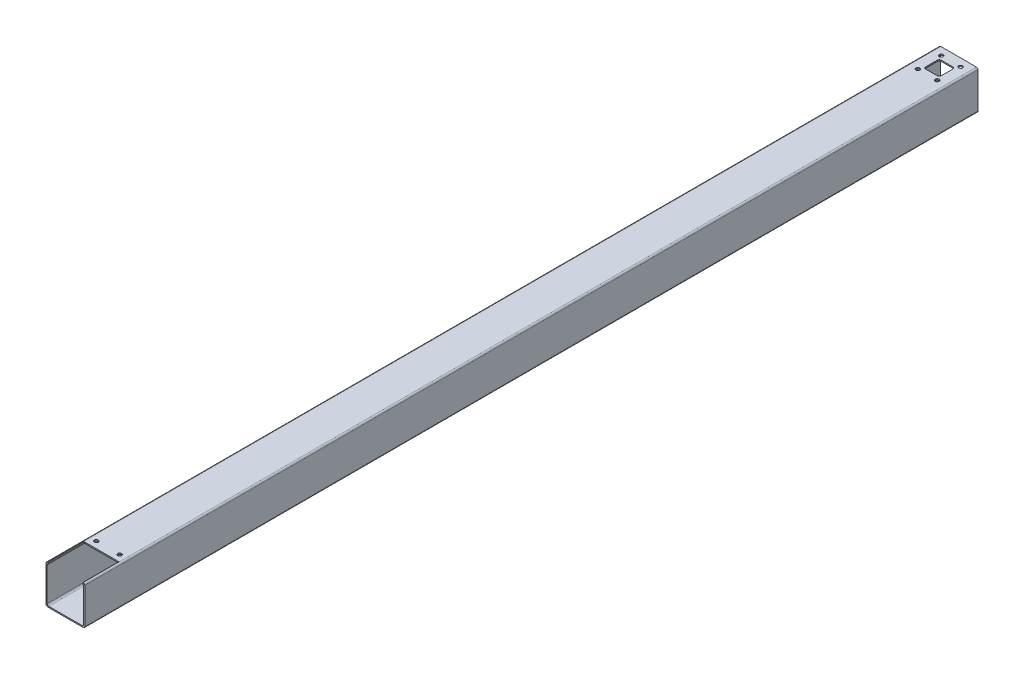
ISO-10303-21;
HEADER;
FILE_DESCRIPTION(('STEP AP214'),'2;1');
FILE_NAME('part.step','',(''),(''),'','','');
FILE_SCHEMA(('AUTOMOTIVE_DESIGN { 1 0 10303 214 1 1 1 1 }'));
ENDSEC;
DATA;
#1=APPLICATION_CONTEXT('core data for automotive mechanical design processes');
#2=APPLICATION_PROTOCOL_DEFINITION('international standard','automotive_design',2000,#1);
#3=PRODUCT_CONTEXT('',#1,'mechanical');
#4=PRODUCT('Part','Part','',(#3));
#5=PRODUCT_RELATED_PRODUCT_CATEGORY('part','',(#4));
#6=PRODUCT_DEFINITION_FORMATION('','',#4);
#7=PRODUCT_DEFINITION_CONTEXT('part definition',#1,'design');
#8=PRODUCT_DEFINITION('design','',#6,#7);
#9=PRODUCT_DEFINITION_SHAPE('','',#8);
#10=(LENGTH_UNIT() NAMED_UNIT(*) SI_UNIT(.MILLI.,.METRE.));
#11=(NAMED_UNIT(*) PLANE_ANGLE_UNIT() SI_UNIT($,.RADIAN.));
#12=(NAMED_UNIT(*) SI_UNIT($,.STERADIAN.) SOLID_ANGLE_UNIT());
#13=UNCERTAINTY_MEASURE_WITH_UNIT(LENGTH_MEASURE(1.E-05),#10,'distance_accuracy_value','');
#14=(GEOMETRIC_REPRESENTATION_CONTEXT(3) GLOBAL_UNCERTAINTY_ASSIGNED_CONTEXT((#13)) GLOBAL_UNIT_ASSIGNED_CONTEXT((#10,
#11,#12)) REPRESENTATION_CONTEXT('',''));
#15=CARTESIAN_POINT('',(0.,0.,0.));
#16=DIRECTION('',(0.,0.,1.));
#17=DIRECTION('',(1.,0.,0.));
#18=AXIS2_PLACEMENT_3D('',#15,#16,#17);
#19=CARTESIAN_POINT('',(0.,0.,2304.));
#20=DIRECTION('',(0.,0.,1.));
#21=DIRECTION('',(1.,0.,0.));
#22=AXIS2_PLACEMENT_3D('',#19,#20,#21);
#23=PLANE('',#22);
#24=DIRECTION('',(0.,1.,0.));
#25=VECTOR('',#24,1.);
#26=CARTESIAN_POINT('',(5.00000000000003,90.,2304.));
#27=LINE('',#26,#25);
#28=CARTESIAN_POINT('',(5.00000000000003,96.4641016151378,2304.));
#29=VERTEX_POINT('',#28);
#30=CARTESIAN_POINT('',(5.00000000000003,100.,2304.));
#31=VERTEX_POINT('',#30);
#32=EDGE_CURVE('E312',#29,#31,#27,.T.);
#33=ORIENTED_EDGE('',*,*,#32,.T.);
#34=DIRECTION('',(-1.,0.,0.));
#35=VECTOR('',#34,1.);
#36=CARTESIAN_POINT('',(0.,100.,2304.));
#37=LINE('',#36,#35);
#38=CARTESIAN_POINT('',(4.,100.,2304.));
#39=VERTEX_POINT('',#38);
#40=EDGE_CURVE('E325',#31,#39,#37,.T.);
#41=ORIENTED_EDGE('',*,*,#40,.T.);
#42=CARTESIAN_POINT('',(4.,96.,2304.));
#43=DIRECTION('',(0.,0.,1.));
#44=DIRECTION('',(1.,0.,0.));
#45=AXIS2_PLACEMENT_3D('',#42,#43,#44);
#46=CIRCLE('',#45,4.);
#47=CARTESIAN_POINT('',(0.,96.,2304.));
#48=VERTEX_POINT('',#47);
#49=EDGE_CURVE('E399',#39,#48,#46,.T.);
#50=ORIENTED_EDGE('',*,*,#49,.T.);
#51=DIRECTION('',(0.,-1.,0.));
#52=VECTOR('',#51,1.);
#53=CARTESIAN_POINT('',(0.,0.,2304.));
#54=LINE('',#53,#52);
#55=CARTESIAN_POINT('',(0.,4.,2304.));
#56=VERTEX_POINT('',#55);
#57=EDGE_CURVE('E370',#48,#56,#54,.T.);
#58=ORIENTED_EDGE('',*,*,#57,.T.);
#59=CARTESIAN_POINT('',(4.,4.,2304.));
#60=DIRECTION('',(0.,0.,1.));
#61=DIRECTION('',(1.,0.,0.));
#62=AXIS2_PLACEMENT_3D('',#59,#60,#61);
#63=CIRCLE('',#62,4.);
#64=CARTESIAN_POINT('',(4.,0.,2304.));
#65=VERTEX_POINT('',#64);
#66=EDGE_CURVE('E401',#56,#65,#63,.T.);
#67=ORIENTED_EDGE('',*,*,#66,.T.);
#68=DIRECTION('',(1.,0.,0.));
#69=VECTOR('',#68,1.);
#70=CARTESIAN_POINT('',(0.,0.,2304.));
#71=LINE('',#70,#69);
#72=CARTESIAN_POINT('',(96.,0.,2304.));
#73=VERTEX_POINT('',#72);
#74=EDGE_CURVE('E350',#65,#73,#71,.T.);
#75=ORIENTED_EDGE('',*,*,#74,.T.);
#76=CARTESIAN_POINT('',(96.,4.,2304.));
#77=DIRECTION('',(0.,0.,1.));
#78=DIRECTION('',(1.,0.,0.));
#79=AXIS2_PLACEMENT_3D('',#76,#77,#78);
#80=CIRCLE('',#79,4.);
#81=CARTESIAN_POINT('',(100.,4.,2304.));
#82=VERTEX_POINT('',#81);
#83=EDGE_CURVE('E404',#73,#82,#80,.T.);
#84=ORIENTED_EDGE('',*,*,#83,.T.);
#85=DIRECTION('',(0.,1.,0.));
#86=VECTOR('',#85,1.);
#87=CARTESIAN_POINT('',(100.,0.,2304.));
#88=LINE('',#87,#86);
#89=CARTESIAN_POINT('',(100.,96.,2304.));
#90=VERTEX_POINT('',#89);
#91=EDGE_CURVE('E341',#82,#90,#88,.T.);
#92=ORIENTED_EDGE('',*,*,#91,.T.);
#93=CARTESIAN_POINT('',(96.,96.,2304.));
#94=DIRECTION('',(0.,0.,1.));
#95=DIRECTION('',(1.,0.,0.));
#96=AXIS2_PLACEMENT_3D('',#93,#94,#95);
#97=CIRCLE('',#96,4.);
#98=CARTESIAN_POINT('',(96.,100.,2304.));
#99=VERTEX_POINT('',#98);
#100=EDGE_CURVE('E396',#90,#99,#97,.T.);
#101=ORIENTED_EDGE('',*,*,#100,.T.);
#102=CARTESIAN_POINT('',(95.,100.,2304.));
#103=VERTEX_POINT('',#102);
#104=EDGE_CURVE('E340',#99,#103,#37,.T.);
#105=ORIENTED_EDGE('',*,*,#104,.T.);
#106=DIRECTION('',(0.,1.,0.));
#107=VECTOR('',#106,1.);
#108=CARTESIAN_POINT('',(95.,90.,2304.));
#109=LINE('',#108,#107);
#110=CARTESIAN_POINT('',(95.,96.4641016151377,2304.));
#111=VERTEX_POINT('',#110);
#112=EDGE_CURVE('E331',#111,#103,#109,.T.);
#113=ORIENTED_EDGE('',*,*,#112,.F.);
#114=CARTESIAN_POINT('',(93.,93.,2304.));
#115=DIRECTION('',(0.,0.,1.));
#116=DIRECTION('',(1.,0.,0.));
#117=AXIS2_PLACEMENT_3D('',#114,#115,#116);
#118=CIRCLE('',#117,4.);
#119=CARTESIAN_POINT('',(97.,93.,2304.));
#120=VERTEX_POINT('',#119);
#121=EDGE_CURVE('E463',#111,#120,#118,.F.);
#122=ORIENTED_EDGE('',*,*,#121,.T.);
#123=DIRECTION('',(0.,1.,0.));
#124=VECTOR('',#123,1.);
#125=CARTESIAN_POINT('',(97.,100.,2304.));
#126=LINE('',#125,#124);
#127=CARTESIAN_POINT('',(97.,7.00000000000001,2304.));
#128=VERTEX_POINT('',#127);
#129=EDGE_CURVE('E359',#128,#120,#126,.T.);
#130=ORIENTED_EDGE('',*,*,#129,.F.);
#131=CARTESIAN_POINT('',(93.,7.,2304.));
#132=DIRECTION('',(0.,0.,1.));
#133=DIRECTION('',(1.,0.,0.));
#134=AXIS2_PLACEMENT_3D('',#131,#132,#133);
#135=CIRCLE('',#134,4.);
#136=CARTESIAN_POINT('',(93.,3.,2304.));
#137=VERTEX_POINT('',#136);
#138=EDGE_CURVE('E457',#128,#137,#135,.F.);
#139=ORIENTED_EDGE('',*,*,#138,.T.);
#140=DIRECTION('',(1.,0.,0.));
#141=VECTOR('',#140,1.);
#142=CARTESIAN_POINT('',(0.,3.,2304.));
#143=LINE('',#142,#141);
#144=CARTESIAN_POINT('',(7.,3.,2304.));
#145=VERTEX_POINT('',#144);
#146=EDGE_CURVE('E623',#145,#137,#143,.T.);
#147=ORIENTED_EDGE('',*,*,#146,.F.);
#148=CARTESIAN_POINT('',(7.,7.00000000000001,2304.));
#149=DIRECTION('',(0.,0.,1.));
#150=DIRECTION('',(1.,0.,0.));
#151=AXIS2_PLACEMENT_3D('',#148,#149,#150);
#152=CIRCLE('',#151,4.);
#153=CARTESIAN_POINT('',(3.,7.00000000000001,2304.));
#154=VERTEX_POINT('',#153);
#155=EDGE_CURVE('E451',#145,#154,#152,.F.);
#156=ORIENTED_EDGE('',*,*,#155,.T.);
#157=DIRECTION('',(0.,-1.,0.));
#158=VECTOR('',#157,1.);
#159=CARTESIAN_POINT('',(3.,100.,2304.));
#160=LINE('',#159,#158);
#161=CARTESIAN_POINT('',(3.,93.,2304.));
#162=VERTEX_POINT('',#161);
#163=EDGE_CURVE('E592',#162,#154,#160,.T.);
#164=ORIENTED_EDGE('',*,*,#163,.F.);
#165=CARTESIAN_POINT('',(7.,93.,2304.));
#166=DIRECTION('',(0.,0.,1.));
#167=DIRECTION('',(1.,0.,0.));
#168=AXIS2_PLACEMENT_3D('',#165,#166,#167);
#169=CIRCLE('',#168,4.);
#170=EDGE_CURVE('E329',#162,#29,#169,.F.);
#171=ORIENTED_EDGE('',*,*,#170,.T.);
#172=EDGE_LOOP('',(#33,#41,#50,#58,#67,#75,#84,#92,#101,#105,#113,#122,#130,#139,#147,#156,#164,#171));
#173=FACE_BOUND('',#172,.T.);
#174=ADVANCED_FACE('F67',(#173),#23,.T.);
#175=CARTESIAN_POINT('',(0.,0.,0.));
#176=DIRECTION('',(0.,0.,1.));
#177=DIRECTION('',(1.,0.,0.));
#178=AXIS2_PLACEMENT_3D('',#175,#176,#177);
#179=PLANE('',#178);
#180=DIRECTION('',(0.,1.,0.));
#181=VECTOR('',#180,1.);
#182=CARTESIAN_POINT('',(100.,0.,0.));
#183=LINE('',#182,#181);
#184=CARTESIAN_POINT('',(100.,4.,0.));
#185=VERTEX_POINT('',#184);
#186=CARTESIAN_POINT('',(100.,96.,0.));
#187=VERTEX_POINT('',#186);
#188=EDGE_CURVE('E363',#185,#187,#183,.T.);
#189=ORIENTED_EDGE('',*,*,#188,.F.);
#190=CARTESIAN_POINT('',(96.,4.,0.));
#191=DIRECTION('',(0.,0.,1.));
#192=DIRECTION('',(1.,0.,0.));
#193=AXIS2_PLACEMENT_3D('',#190,#191,#192);
#194=CIRCLE('',#193,4.);
#195=CARTESIAN_POINT('',(96.,0.,0.));
#196=VERTEX_POINT('',#195);
#197=EDGE_CURVE('E386',#185,#196,#194,.F.);
#198=ORIENTED_EDGE('',*,*,#197,.T.);
#199=DIRECTION('',(1.,0.,0.));
#200=VECTOR('',#199,1.);
#201=CARTESIAN_POINT('',(0.,0.,0.));
#202=LINE('',#201,#200);
#203=CARTESIAN_POINT('',(4.,0.,0.));
#204=VERTEX_POINT('',#203);
#205=EDGE_CURVE('E358',#204,#196,#202,.T.);
#206=ORIENTED_EDGE('',*,*,#205,.F.);
#207=CARTESIAN_POINT('',(4.,4.,0.));
#208=DIRECTION('',(0.,0.,1.));
#209=DIRECTION('',(1.,0.,0.));
#210=AXIS2_PLACEMENT_3D('',#207,#208,#209);
#211=CIRCLE('',#210,4.);
#212=CARTESIAN_POINT('',(0.,4.,0.));
#213=VERTEX_POINT('',#212);
#214=EDGE_CURVE('E383',#204,#213,#211,.F.);
#215=ORIENTED_EDGE('',*,*,#214,.T.);
#216=DIRECTION('',(0.,-1.,0.));
#217=VECTOR('',#216,1.);
#218=CARTESIAN_POINT('',(0.,0.,0.));
#219=LINE('',#218,#217);
#220=CARTESIAN_POINT('',(0.,96.,0.));
#221=VERTEX_POINT('',#220);
#222=EDGE_CURVE('E354',#221,#213,#219,.T.);
#223=ORIENTED_EDGE('',*,*,#222,.F.);
#224=CARTESIAN_POINT('',(4.,96.,0.));
#225=DIRECTION('',(0.,0.,1.));
#226=DIRECTION('',(1.,0.,0.));
#227=AXIS2_PLACEMENT_3D('',#224,#225,#226);
#228=CIRCLE('',#227,4.);
#229=CARTESIAN_POINT('',(4.,100.,0.));
#230=VERTEX_POINT('',#229);
#231=EDGE_CURVE('E380',#221,#230,#228,.F.);
#232=ORIENTED_EDGE('',*,*,#231,.T.);
#233=DIRECTION('',(-1.,0.,0.));
#234=VECTOR('',#233,1.);
#235=CARTESIAN_POINT('',(0.,100.,0.));
#236=LINE('',#235,#234);
#237=CARTESIAN_POINT('',(96.,100.,0.));
#238=VERTEX_POINT('',#237);
#239=EDGE_CURVE('E367',#238,#230,#236,.T.);
#240=ORIENTED_EDGE('',*,*,#239,.F.);
#241=CARTESIAN_POINT('',(96.,96.,0.));
#242=DIRECTION('',(0.,0.,1.));
#243=DIRECTION('',(1.,0.,0.));
#244=AXIS2_PLACEMENT_3D('',#241,#242,#243);
#245=CIRCLE('',#244,4.);
#246=EDGE_CURVE('E377',#238,#187,#245,.F.);
#247=ORIENTED_EDGE('',*,*,#246,.T.);
#248=EDGE_LOOP('',(#189,#198,#206,#215,#223,#232,#240,#247));
#249=FACE_BOUND('',#248,.T.);
#250=DIRECTION('',(-1.,0.,0.));
#251=VECTOR('',#250,1.);
#252=CARTESIAN_POINT('',(0.,97.,0.));
#253=LINE('',#252,#251);
#254=CARTESIAN_POINT('',(93.,97.,0.));
#255=VERTEX_POINT('',#254);
#256=CARTESIAN_POINT('',(7.,97.,0.));
#257=VERTEX_POINT('',#256);
#258=EDGE_CURVE('E587',#255,#257,#253,.T.);
#259=ORIENTED_EDGE('',*,*,#258,.T.);
#260=CARTESIAN_POINT('',(7.,93.,0.));
#261=DIRECTION('',(0.,0.,1.));
#262=DIRECTION('',(1.,0.,0.));
#263=AXIS2_PLACEMENT_3D('',#260,#261,#262);
#264=CIRCLE('',#263,4.);
#265=CARTESIAN_POINT('',(3.,93.,0.));
#266=VERTEX_POINT('',#265);
#267=EDGE_CURVE('E466',#257,#266,#264,.T.);
#268=ORIENTED_EDGE('',*,*,#267,.T.);
#269=DIRECTION('',(0.,-1.,0.));
#270=VECTOR('',#269,1.);
#271=CARTESIAN_POINT('',(3.,100.,0.));
#272=LINE('',#271,#270);
#273=CARTESIAN_POINT('',(3.,7.00000000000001,0.));
#274=VERTEX_POINT('',#273);
#275=EDGE_CURVE('E576',#266,#274,#272,.T.);
#276=ORIENTED_EDGE('',*,*,#275,.T.);
#277=CARTESIAN_POINT('',(7.,7.00000000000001,0.));
#278=DIRECTION('',(0.,0.,1.));
#279=DIRECTION('',(1.,0.,0.));
#280=AXIS2_PLACEMENT_3D('',#277,#278,#279);
#281=CIRCLE('',#280,4.);
#282=CARTESIAN_POINT('',(7.,3.,0.));
#283=VERTEX_POINT('',#282);
#284=EDGE_CURVE('E448',#274,#283,#281,.T.);
#285=ORIENTED_EDGE('',*,*,#284,.T.);
#286=DIRECTION('',(1.,0.,0.));
#287=VECTOR('',#286,1.);
#288=CARTESIAN_POINT('',(0.,3.,0.));
#289=LINE('',#288,#287);
#290=CARTESIAN_POINT('',(93.,3.,0.));
#291=VERTEX_POINT('',#290);
#292=EDGE_CURVE('E578',#283,#291,#289,.T.);
#293=ORIENTED_EDGE('',*,*,#292,.T.);
#294=CARTESIAN_POINT('',(93.,7.,0.));
#295=DIRECTION('',(0.,0.,1.));
#296=DIRECTION('',(1.,0.,0.));
#297=AXIS2_PLACEMENT_3D('',#294,#295,#296);
#298=CIRCLE('',#297,4.);
#299=CARTESIAN_POINT('',(97.,7.00000000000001,0.));
#300=VERTEX_POINT('',#299);
#301=EDGE_CURVE('E454',#291,#300,#298,.T.);
#302=ORIENTED_EDGE('',*,*,#301,.T.);
#303=DIRECTION('',(0.,1.,0.));
#304=VECTOR('',#303,1.);
#305=CARTESIAN_POINT('',(97.,100.,0.));
#306=LINE('',#305,#304);
#307=CARTESIAN_POINT('',(97.,93.,0.));
#308=VERTEX_POINT('',#307);
#309=EDGE_CURVE('E583',#300,#308,#306,.T.);
#310=ORIENTED_EDGE('',*,*,#309,.T.);
#311=CARTESIAN_POINT('',(93.,93.,0.));
#312=DIRECTION('',(0.,0.,1.));
#313=DIRECTION('',(1.,0.,0.));
#314=AXIS2_PLACEMENT_3D('',#311,#312,#313);
#315=CIRCLE('',#314,4.);
#316=EDGE_CURVE('E460',#308,#255,#315,.T.);
#317=ORIENTED_EDGE('',*,*,#316,.T.);
#318=EDGE_LOOP('',(#259,#268,#276,#285,#293,#302,#310,#317));
#319=FACE_BOUND('',#318,.T.);
#320=ADVANCED_FACE('F649',(#249,#319),#179,.F.);
#321=CARTESIAN_POINT('',(0.,0.,2304.));
#322=DIRECTION('',(1.,0.,0.));
#323=DIRECTION('',(0.,0.,-1.));
#324=AXIS2_PLACEMENT_3D('',#321,#322,#323);
#325=PLANE('',#324);
#326=ORIENTED_EDGE('',*,*,#222,.T.);
#327=DIRECTION('',(0.,0.,-1.));
#328=VECTOR('',#327,1.);
#329=CARTESIAN_POINT('',(0.,4.,2304.));
#330=LINE('',#329,#328);
#331=EDGE_CURVE('E411',#213,#56,#330,.F.);
#332=ORIENTED_EDGE('',*,*,#331,.T.);
#333=ORIENTED_EDGE('',*,*,#57,.F.);
#334=DIRECTION('',(0.,0.,-1.));
#335=VECTOR('',#334,1.);
#336=CARTESIAN_POINT('',(0.,96.,2304.));
#337=LINE('',#336,#335);
#338=EDGE_CURVE('E407',#48,#221,#337,.T.);
#339=ORIENTED_EDGE('',*,*,#338,.T.);
#340=EDGE_LOOP('',(#326,#332,#333,#339));
#341=FACE_BOUND('',#340,.T.);
#342=ADVANCED_FACE('F741',(#341),#325,.F.);
#343=CARTESIAN_POINT('',(0.,0.,2304.));
#344=DIRECTION('',(0.,1.,0.));
#345=DIRECTION('',(0.,0.,1.));
#346=AXIS2_PLACEMENT_3D('',#343,#344,#345);
#347=PLANE('',#346);
#348=ORIENTED_EDGE('',*,*,#205,.T.);
#349=DIRECTION('',(0.,0.,-1.));
#350=VECTOR('',#349,1.);
#351=CARTESIAN_POINT('',(96.,0.,2304.));
#352=LINE('',#351,#350);
#353=EDGE_CURVE('E393',#196,#73,#352,.F.);
#354=ORIENTED_EDGE('',*,*,#353,.T.);
#355=ORIENTED_EDGE('',*,*,#74,.F.);
#356=DIRECTION('',(0.,0.,-1.));
#357=VECTOR('',#356,1.);
#358=CARTESIAN_POINT('',(4.,0.,2304.));
#359=LINE('',#358,#357);
#360=EDGE_CURVE('E389',#65,#204,#359,.T.);
#361=ORIENTED_EDGE('',*,*,#360,.T.);
#362=EDGE_LOOP('',(#348,#354,#355,#361));
#363=FACE_BOUND('',#362,.T.);
#364=ADVANCED_FACE('F731',(#363),#347,.F.);
#365=CARTESIAN_POINT('',(100.,0.,2304.));
#366=DIRECTION('',(-1.,0.,0.));
#367=DIRECTION('',(0.,0.,1.));
#368=AXIS2_PLACEMENT_3D('',#365,#366,#367);
#369=PLANE('',#368);
#370=ORIENTED_EDGE('',*,*,#91,.F.);
#371=DIRECTION('',(0.,0.,-1.));
#372=VECTOR('',#371,1.);
#373=CARTESIAN_POINT('',(100.,4.,2304.));
#374=LINE('',#373,#372);
#375=EDGE_CURVE('E373',#82,#185,#374,.T.);
#376=ORIENTED_EDGE('',*,*,#375,.T.);
#377=ORIENTED_EDGE('',*,*,#188,.T.);
#378=DIRECTION('',(0.,0.,-1.));
#379=VECTOR('',#378,1.);
#380=CARTESIAN_POINT('',(100.,96.,2304.));
#381=LINE('',#380,#379);
#382=EDGE_CURVE('E347',#187,#90,#381,.F.);
#383=ORIENTED_EDGE('',*,*,#382,.T.);
#384=EDGE_LOOP('',(#370,#376,#377,#383));
#385=FACE_BOUND('',#384,.T.);
#386=ADVANCED_FACE('F646',(#385),#369,.F.);
#387=CARTESIAN_POINT('',(0.,100.,2304.));
#388=DIRECTION('',(0.,-1.,0.));
#389=DIRECTION('',(0.,0.,-1.));
#390=AXIS2_PLACEMENT_3D('',#387,#388,#389);
#391=PLANE('',#390);
#392=CARTESIAN_POINT('',(25.,100.,20.));
#393=DIRECTION('',(0.,1.,0.));
#394=DIRECTION('',(0.,0.,1.));
#395=AXIS2_PLACEMENT_3D('',#392,#393,#394);
#396=CIRCLE('',#395,5.);
#397=CARTESIAN_POINT('',(25.,100.,25.));
#398=VERTEX_POINT('',#397);
#399=EDGE_CURVE('E528',#398,#398,#396,.T.);
#400=ORIENTED_EDGE('',*,*,#399,.F.);
#401=EDGE_LOOP('',(#400));
#402=FACE_BOUND('',#401,.T.);
#403=CARTESIAN_POINT('',(75.,100.,20.));
#404=DIRECTION('',(0.,1.,0.));
#405=DIRECTION('',(0.,0.,1.));
#406=AXIS2_PLACEMENT_3D('',#403,#404,#405);
#407=CIRCLE('',#406,5.);
#408=CARTESIAN_POINT('',(75.,100.,25.));
#409=VERTEX_POINT('',#408);
#410=EDGE_CURVE('E523',#409,#409,#407,.T.);
#411=ORIENTED_EDGE('',*,*,#410,.F.);
#412=EDGE_LOOP('',(#411));
#413=FACE_BOUND('',#412,.T.);
#414=CARTESIAN_POINT('',(75.,100.,80.));
#415=DIRECTION('',(0.,1.,0.));
#416=DIRECTION('',(0.,0.,1.));
#417=AXIS2_PLACEMENT_3D('',#414,#415,#416);
#418=CIRCLE('',#417,5.00000000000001);
#419=CARTESIAN_POINT('',(75.,100.,85.));
#420=VERTEX_POINT('',#419);
#421=EDGE_CURVE('E518',#420,#420,#418,.T.);
#422=ORIENTED_EDGE('',*,*,#421,.F.);
#423=EDGE_LOOP('',(#422));
#424=FACE_BOUND('',#423,.T.);
#425=CARTESIAN_POINT('',(25.,100.,80.));
#426=DIRECTION('',(0.,1.,0.));
#427=DIRECTION('',(0.,0.,1.));
#428=AXIS2_PLACEMENT_3D('',#425,#426,#427);
#429=CIRCLE('',#428,5.00000000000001);
#430=CARTESIAN_POINT('',(25.,100.,85.));
#431=VERTEX_POINT('',#430);
#432=EDGE_CURVE('E513',#431,#431,#429,.T.);
#433=ORIENTED_EDGE('',*,*,#432,.F.);
#434=EDGE_LOOP('',(#433));
#435=FACE_BOUND('',#434,.T.);
#436=DIRECTION('',(-1.,0.,0.));
#437=VECTOR('',#436,1.);
#438=CARTESIAN_POINT('',(70.,100.,30.));
#439=LINE('',#438,#437);
#440=CARTESIAN_POINT('',(65.,100.,30.));
#441=VERTEX_POINT('',#440);
#442=CARTESIAN_POINT('',(35.,100.,30.));
#443=VERTEX_POINT('',#442);
#444=EDGE_CURVE('E597',#441,#443,#439,.T.);
#445=ORIENTED_EDGE('',*,*,#444,.F.);
#446=CARTESIAN_POINT('',(65.,100.,35.));
#447=DIRECTION('',(0.,-1.,0.));
#448=DIRECTION('',(0.,0.,-1.));
#449=AXIS2_PLACEMENT_3D('',#446,#447,#448);
#450=CIRCLE('',#449,5.);
#451=CARTESIAN_POINT('',(70.,100.,35.));
#452=VERTEX_POINT('',#451);
#453=EDGE_CURVE('E561',#441,#452,#450,.T.);
#454=ORIENTED_EDGE('',*,*,#453,.T.);
#455=DIRECTION('',(0.,0.,-1.));
#456=VECTOR('',#455,1.);
#457=CARTESIAN_POINT('',(70.,100.,30.));
#458=LINE('',#457,#456);
#459=CARTESIAN_POINT('',(70.,100.,65.));
#460=VERTEX_POINT('',#459);
#461=EDGE_CURVE('E512',#460,#452,#458,.T.);
#462=ORIENTED_EDGE('',*,*,#461,.F.);
#463=CARTESIAN_POINT('',(65.,100.,65.));
#464=DIRECTION('',(0.,-1.,0.));
#465=DIRECTION('',(0.,0.,-1.));
#466=AXIS2_PLACEMENT_3D('',#463,#464,#465);
#467=CIRCLE('',#466,5.);
#468=CARTESIAN_POINT('',(65.,100.,70.));
#469=VERTEX_POINT('',#468);
#470=EDGE_CURVE('E555',#460,#469,#467,.T.);
#471=ORIENTED_EDGE('',*,*,#470,.T.);
#472=DIRECTION('',(1.,0.,0.));
#473=VECTOR('',#472,1.);
#474=CARTESIAN_POINT('',(70.,100.,70.));
#475=LINE('',#474,#473);
#476=CARTESIAN_POINT('',(35.,100.,70.));
#477=VERTEX_POINT('',#476);
#478=EDGE_CURVE('E603',#477,#469,#475,.T.);
#479=ORIENTED_EDGE('',*,*,#478,.F.);
#480=CARTESIAN_POINT('',(35.,100.,65.));
#481=DIRECTION('',(0.,-1.,0.));
#482=DIRECTION('',(0.,0.,-1.));
#483=AXIS2_PLACEMENT_3D('',#480,#481,#482);
#484=CIRCLE('',#483,5.);
#485=CARTESIAN_POINT('',(30.,100.,65.));
#486=VERTEX_POINT('',#485);
#487=EDGE_CURVE('E76',#477,#486,#484,.T.);
#488=ORIENTED_EDGE('',*,*,#487,.T.);
#489=DIRECTION('',(0.,0.,1.));
#490=VECTOR('',#489,1.);
#491=CARTESIAN_POINT('',(30.,100.,30.));
#492=LINE('',#491,#490);
#493=CARTESIAN_POINT('',(30.,100.,35.));
#494=VERTEX_POINT('',#493);
#495=EDGE_CURVE('E599',#494,#486,#492,.T.);
#496=ORIENTED_EDGE('',*,*,#495,.F.);
#497=CARTESIAN_POINT('',(35.,100.,35.));
#498=DIRECTION('',(0.,-1.,0.));
#499=DIRECTION('',(0.,0.,-1.));
#500=AXIS2_PLACEMENT_3D('',#497,#498,#499);
#501=CIRCLE('',#500,5.);
#502=EDGE_CURVE('E96',#494,#443,#501,.T.);
#503=ORIENTED_EDGE('',*,*,#502,.T.);
#504=EDGE_LOOP('',(#445,#454,#462,#471,#479,#488,#496,#503));
#505=FACE_BOUND('',#504,.T.);
#506=CARTESIAN_POINT('',(80.,100.,2194.));
#507=DIRECTION('',(0.,1.,0.));
#508=DIRECTION('',(0.,0.,1.));
#509=AXIS2_PLACEMENT_3D('',#506,#507,#508);
#510=CIRCLE('',#509,4.99999999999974);
#511=CARTESIAN_POINT('',(80.,100.,2199.));
#512=VERTEX_POINT('',#511);
#513=EDGE_CURVE('E491',#512,#512,#510,.T.);
#514=ORIENTED_EDGE('',*,*,#513,.F.);
#515=EDGE_LOOP('',(#514));
#516=FACE_BOUND('',#515,.T.);
#517=CARTESIAN_POINT('',(20.,100.,2194.));
#518=DIRECTION('',(0.,1.,0.));
#519=DIRECTION('',(0.,0.,1.));
#520=AXIS2_PLACEMENT_3D('',#517,#518,#519);
#521=CIRCLE('',#520,4.99999999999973);
#522=CARTESIAN_POINT('',(20.,100.,2199.));
#523=VERTEX_POINT('',#522);
#524=EDGE_CURVE('E486',#523,#523,#521,.T.);
#525=ORIENTED_EDGE('',*,*,#524,.F.);
#526=EDGE_LOOP('',(#525));
#527=FACE_BOUND('',#526,.T.);
#528=ORIENTED_EDGE('',*,*,#40,.F.);
#529=DIRECTION('',(0.,0.,1.));
#530=VECTOR('',#529,1.);
#531=CARTESIAN_POINT('',(5.00000000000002,100.,2211.));
#532=LINE('',#531,#530);
#533=CARTESIAN_POINT('',(5.00000000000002,100.,2211.));
#534=VERTEX_POINT('',#533);
#535=EDGE_CURVE('E308',#534,#31,#532,.T.);
#536=ORIENTED_EDGE('',*,*,#535,.F.);
#537=DIRECTION('',(-1.,0.,0.));
#538=VECTOR('',#537,1.);
#539=CARTESIAN_POINT('',(5.00000000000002,100.,2211.));
#540=LINE('',#539,#538);
#541=CARTESIAN_POINT('',(95.,100.,2211.));
#542=VERTEX_POINT('',#541);
#543=EDGE_CURVE('E332',#542,#534,#540,.T.);
#544=ORIENTED_EDGE('',*,*,#543,.F.);
#545=DIRECTION('',(0.,0.,-1.));
#546=VECTOR('',#545,1.);
#547=CARTESIAN_POINT('',(95.,100.,2211.));
#548=LINE('',#547,#546);
#549=EDGE_CURVE('E320',#103,#542,#548,.T.);
#550=ORIENTED_EDGE('',*,*,#549,.F.);
#551=ORIENTED_EDGE('',*,*,#104,.F.);
#552=DIRECTION('',(0.,0.,-1.));
#553=VECTOR('',#552,1.);
#554=CARTESIAN_POINT('',(96.,100.,2304.));
#555=LINE('',#554,#553);
#556=EDGE_CURVE('E414',#99,#238,#555,.T.);
#557=ORIENTED_EDGE('',*,*,#556,.T.);
#558=ORIENTED_EDGE('',*,*,#239,.T.);
#559=DIRECTION('',(0.,0.,-1.));
#560=VECTOR('',#559,1.);
#561=CARTESIAN_POINT('',(4.,100.,2304.));
#562=LINE('',#561,#560);
#563=EDGE_CURVE('E337',#230,#39,#562,.F.);
#564=ORIENTED_EDGE('',*,*,#563,.T.);
#565=EDGE_LOOP('',(#528,#536,#544,#550,#551,#557,#558,#564));
#566=FACE_BOUND('',#565,.T.);
#567=ADVANCED_FACE('F334',(#402,#413,#424,#435,#505,#516,#527,#566),#391,.F.);
#568=CARTESIAN_POINT('',(3.,100.,2304.));
#569=DIRECTION('',(1.,0.,0.));
#570=DIRECTION('',(0.,0.,-1.));
#571=AXIS2_PLACEMENT_3D('',#568,#569,#570);
#572=PLANE('',#571);
#573=ORIENTED_EDGE('',*,*,#163,.T.);
#574=DIRECTION('',(0.,0.,-1.));
#575=VECTOR('',#574,1.);
#576=CARTESIAN_POINT('',(3.,7.00000000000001,0.));
#577=LINE('',#576,#575);
#578=EDGE_CURVE('E423',#154,#274,#577,.T.);
#579=ORIENTED_EDGE('',*,*,#578,.T.);
#580=ORIENTED_EDGE('',*,*,#275,.F.);
#581=DIRECTION('',(0.,0.,-1.));
#582=VECTOR('',#581,1.);
#583=CARTESIAN_POINT('',(3.,93.,2304.));
#584=LINE('',#583,#582);
#585=EDGE_CURVE('E420',#266,#162,#584,.F.);
#586=ORIENTED_EDGE('',*,*,#585,.T.);
#587=EDGE_LOOP('',(#573,#579,#580,#586));
#588=FACE_BOUND('',#587,.T.);
#589=ADVANCED_FACE('F688',(#588),#572,.T.);
#590=CARTESIAN_POINT('',(0.,3.,2304.));
#591=DIRECTION('',(0.,1.,0.));
#592=DIRECTION('',(0.,0.,1.));
#593=AXIS2_PLACEMENT_3D('',#590,#591,#592);
#594=PLANE('',#593);
#595=ORIENTED_EDGE('',*,*,#292,.F.);
#596=DIRECTION('',(0.,0.,-1.));
#597=VECTOR('',#596,1.);
#598=CARTESIAN_POINT('',(7.,3.,2304.));
#599=LINE('',#598,#597);
#600=EDGE_CURVE('E431',#283,#145,#599,.F.);
#601=ORIENTED_EDGE('',*,*,#600,.T.);
#602=ORIENTED_EDGE('',*,*,#146,.T.);
#603=DIRECTION('',(0.,0.,-1.));
#604=VECTOR('',#603,1.);
#605=CARTESIAN_POINT('',(93.,3.,0.));
#606=LINE('',#605,#604);
#607=EDGE_CURVE('E427',#137,#291,#606,.T.);
#608=ORIENTED_EDGE('',*,*,#607,.T.);
#609=EDGE_LOOP('',(#595,#601,#602,#608));
#610=FACE_BOUND('',#609,.T.);
#611=ADVANCED_FACE('F679',(#610),#594,.T.);
#612=CARTESIAN_POINT('',(97.,100.,2304.));
#613=DIRECTION('',(-1.,0.,0.));
#614=DIRECTION('',(0.,0.,1.));
#615=AXIS2_PLACEMENT_3D('',#612,#613,#614);
#616=PLANE('',#615);
#617=ORIENTED_EDGE('',*,*,#309,.F.);
#618=DIRECTION('',(0.,0.,-1.));
#619=VECTOR('',#618,1.);
#620=CARTESIAN_POINT('',(97.,7.,2304.));
#621=LINE('',#620,#619);
#622=EDGE_CURVE('E438',#300,#128,#621,.F.);
#623=ORIENTED_EDGE('',*,*,#622,.T.);
#624=ORIENTED_EDGE('',*,*,#129,.T.);
#625=DIRECTION('',(0.,0.,-1.));
#626=VECTOR('',#625,1.);
#627=CARTESIAN_POINT('',(97.,93.,0.));
#628=LINE('',#627,#626);
#629=EDGE_CURVE('E434',#120,#308,#628,.T.);
#630=ORIENTED_EDGE('',*,*,#629,.T.);
#631=EDGE_LOOP('',(#617,#623,#624,#630));
#632=FACE_BOUND('',#631,.T.);
#633=ADVANCED_FACE('F670',(#632),#616,.T.);
#634=CARTESIAN_POINT('',(0.,97.,2304.));
#635=DIRECTION('',(0.,-1.,0.));
#636=DIRECTION('',(0.,0.,-1.));
#637=AXIS2_PLACEMENT_3D('',#634,#635,#636);
#638=PLANE('',#637);
#639=CARTESIAN_POINT('',(25.,97.,20.));
#640=DIRECTION('',(0.,-1.,0.));
#641=DIRECTION('',(0.,0.,-1.));
#642=AXIS2_PLACEMENT_3D('',#639,#640,#641);
#643=CIRCLE('',#642,5.);
#644=CARTESIAN_POINT('',(25.,97.,15.));
#645=VERTEX_POINT('',#644);
#646=EDGE_CURVE('E524',#645,#645,#643,.T.);
#647=ORIENTED_EDGE('',*,*,#646,.F.);
#648=EDGE_LOOP('',(#647));
#649=FACE_BOUND('',#648,.T.);
#650=CARTESIAN_POINT('',(75.,97.,20.));
#651=DIRECTION('',(0.,-1.,0.));
#652=DIRECTION('',(0.,0.,-1.));
#653=AXIS2_PLACEMENT_3D('',#650,#651,#652);
#654=CIRCLE('',#653,5.);
#655=CARTESIAN_POINT('',(75.,97.,15.));
#656=VERTEX_POINT('',#655);
#657=EDGE_CURVE('E519',#656,#656,#654,.T.);
#658=ORIENTED_EDGE('',*,*,#657,.F.);
#659=EDGE_LOOP('',(#658));
#660=FACE_BOUND('',#659,.T.);
#661=CARTESIAN_POINT('',(75.,97.,80.));
#662=DIRECTION('',(0.,-1.,0.));
#663=DIRECTION('',(0.,0.,-1.));
#664=AXIS2_PLACEMENT_3D('',#661,#662,#663);
#665=CIRCLE('',#664,5.00000000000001);
#666=CARTESIAN_POINT('',(75.,97.,75.));
#667=VERTEX_POINT('',#666);
#668=EDGE_CURVE('E514',#667,#667,#665,.T.);
#669=ORIENTED_EDGE('',*,*,#668,.F.);
#670=EDGE_LOOP('',(#669));
#671=FACE_BOUND('',#670,.T.);
#672=CARTESIAN_POINT('',(25.,97.,80.));
#673=DIRECTION('',(0.,-1.,0.));
#674=DIRECTION('',(0.,0.,-1.));
#675=AXIS2_PLACEMENT_3D('',#672,#673,#674);
#676=CIRCLE('',#675,5.00000000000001);
#677=CARTESIAN_POINT('',(25.,97.,75.));
#678=VERTEX_POINT('',#677);
#679=EDGE_CURVE('E508',#678,#678,#676,.T.);
#680=ORIENTED_EDGE('',*,*,#679,.F.);
#681=EDGE_LOOP('',(#680));
#682=FACE_BOUND('',#681,.T.);
#683=DIRECTION('',(0.,0.,1.));
#684=VECTOR('',#683,1.);
#685=CARTESIAN_POINT('',(70.,97.,2304.));
#686=LINE('',#685,#684);
#687=CARTESIAN_POINT('',(70.,97.,35.0000000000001));
#688=VERTEX_POINT('',#687);
#689=CARTESIAN_POINT('',(70.,97.,64.9999999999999));
#690=VERTEX_POINT('',#689);
#691=EDGE_CURVE('E503',#688,#690,#686,.T.);
#692=ORIENTED_EDGE('',*,*,#691,.F.);
#693=CARTESIAN_POINT('',(65.,97.,35.));
#694=DIRECTION('',(0.,-1.,0.));
#695=DIRECTION('',(0.,0.,-1.));
#696=AXIS2_PLACEMENT_3D('',#693,#694,#695);
#697=CIRCLE('',#696,5.);
#698=CARTESIAN_POINT('',(65.,97.,29.9999999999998));
#699=VERTEX_POINT('',#698);
#700=EDGE_CURVE('E564',#688,#699,#697,.F.);
#701=ORIENTED_EDGE('',*,*,#700,.T.);
#702=DIRECTION('',(1.,0.,0.));
#703=VECTOR('',#702,1.);
#704=CARTESIAN_POINT('',(-3.94476118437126E-13,97.,29.9999999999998));
#705=LINE('',#704,#703);
#706=CARTESIAN_POINT('',(35.,97.,29.9999999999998));
#707=VERTEX_POINT('',#706);
#708=EDGE_CURVE('E482',#707,#699,#705,.T.);
#709=ORIENTED_EDGE('',*,*,#708,.F.);
#710=CARTESIAN_POINT('',(35.,97.,35.));
#711=DIRECTION('',(0.,-1.,0.));
#712=DIRECTION('',(0.,0.,-1.));
#713=AXIS2_PLACEMENT_3D('',#710,#711,#712);
#714=CIRCLE('',#713,5.);
#715=CARTESIAN_POINT('',(30.,97.,35.0000000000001));
#716=VERTEX_POINT('',#715);
#717=EDGE_CURVE('E569',#707,#716,#714,.F.);
#718=ORIENTED_EDGE('',*,*,#717,.T.);
#719=DIRECTION('',(0.,0.,-1.));
#720=VECTOR('',#719,1.);
#721=CARTESIAN_POINT('',(30.0000000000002,97.,2304.));
#722=LINE('',#721,#720);
#723=CARTESIAN_POINT('',(30.,97.,64.9999999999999));
#724=VERTEX_POINT('',#723);
#725=EDGE_CURVE('E495',#724,#716,#722,.T.);
#726=ORIENTED_EDGE('',*,*,#725,.F.);
#727=CARTESIAN_POINT('',(35.,97.,65.));
#728=DIRECTION('',(0.,-1.,0.));
#729=DIRECTION('',(0.,0.,-1.));
#730=AXIS2_PLACEMENT_3D('',#727,#728,#729);
#731=CIRCLE('',#730,5.);
#732=CARTESIAN_POINT('',(35.,97.,69.9999999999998));
#733=VERTEX_POINT('',#732);
#734=EDGE_CURVE('E12',#724,#733,#731,.F.);
#735=ORIENTED_EDGE('',*,*,#734,.T.);
#736=DIRECTION('',(-1.,0.,0.));
#737=VECTOR('',#736,1.);
#738=CARTESIAN_POINT('',(0.,97.,69.9999999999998));
#739=LINE('',#738,#737);
#740=CARTESIAN_POINT('',(65.,97.,69.9999999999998));
#741=VERTEX_POINT('',#740);
#742=EDGE_CURVE('E499',#741,#733,#739,.T.);
#743=ORIENTED_EDGE('',*,*,#742,.F.);
#744=CARTESIAN_POINT('',(65.,97.,65.));
#745=DIRECTION('',(0.,-1.,0.));
#746=DIRECTION('',(0.,0.,-1.));
#747=AXIS2_PLACEMENT_3D('',#744,#745,#746);
#748=CIRCLE('',#747,5.);
#749=EDGE_CURVE('E558',#741,#690,#748,.F.);
#750=ORIENTED_EDGE('',*,*,#749,.T.);
#751=EDGE_LOOP('',(#692,#701,#709,#718,#726,#735,#743,#750));
#752=FACE_BOUND('',#751,.T.);
#753=CARTESIAN_POINT('',(80.,97.,2194.));
#754=DIRECTION('',(0.,-1.,0.));
#755=DIRECTION('',(0.,0.,-1.));
#756=AXIS2_PLACEMENT_3D('',#753,#754,#755);
#757=CIRCLE('',#756,4.99999999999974);
#758=CARTESIAN_POINT('',(80.,97.,2189.));
#759=VERTEX_POINT('',#758);
#760=EDGE_CURVE('E487',#759,#759,#757,.T.);
#761=ORIENTED_EDGE('',*,*,#760,.F.);
#762=EDGE_LOOP('',(#761));
#763=FACE_BOUND('',#762,.T.);
#764=CARTESIAN_POINT('',(20.,97.,2194.));
#765=DIRECTION('',(0.,-1.,0.));
#766=DIRECTION('',(0.,0.,-1.));
#767=AXIS2_PLACEMENT_3D('',#764,#765,#766);
#768=CIRCLE('',#767,4.99999999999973);
#769=CARTESIAN_POINT('',(20.,97.,2189.));
#770=VERTEX_POINT('',#769);
#771=EDGE_CURVE('E321',#770,#770,#768,.T.);
#772=ORIENTED_EDGE('',*,*,#771,.F.);
#773=EDGE_LOOP('',(#772));
#774=FACE_BOUND('',#773,.T.);
#775=DIRECTION('',(1.,0.,0.));
#776=VECTOR('',#775,1.);
#777=CARTESIAN_POINT('',(0.,97.,2211.));
#778=LINE('',#777,#776);
#779=CARTESIAN_POINT('',(7.,97.,2211.));
#780=VERTEX_POINT('',#779);
#781=CARTESIAN_POINT('',(93.,97.,2211.));
#782=VERTEX_POINT('',#781);
#783=EDGE_CURVE('E608',#780,#782,#778,.T.);
#784=ORIENTED_EDGE('',*,*,#783,.F.);
#785=DIRECTION('',(0.,0.,-1.));
#786=VECTOR('',#785,1.);
#787=CARTESIAN_POINT('',(7.,97.,0.));
#788=LINE('',#787,#786);
#789=EDGE_CURVE('E441',#780,#257,#788,.T.);
#790=ORIENTED_EDGE('',*,*,#789,.T.);
#791=ORIENTED_EDGE('',*,*,#258,.F.);
#792=DIRECTION('',(0.,0.,-1.));
#793=VECTOR('',#792,1.);
#794=CARTESIAN_POINT('',(93.,97.,2304.));
#795=LINE('',#794,#793);
#796=EDGE_CURVE('E444',#255,#782,#795,.F.);
#797=ORIENTED_EDGE('',*,*,#796,.T.);
#798=EDGE_LOOP('',(#784,#790,#791,#797));
#799=FACE_BOUND('',#798,.T.);
#800=ADVANCED_FACE('F698',(#649,#660,#671,#682,#752,#763,#774,#799),#638,.T.);
#801=CARTESIAN_POINT('',(96.,4.,2304.));
#802=DIRECTION('',(0.,0.,-1.));
#803=DIRECTION('',(-1.,0.,0.));
#804=AXIS2_PLACEMENT_3D('',#801,#802,#803);
#805=CYLINDRICAL_SURFACE('',#804,4.);
#806=ORIENTED_EDGE('',*,*,#83,.F.);
#807=ORIENTED_EDGE('',*,*,#353,.F.);
#808=ORIENTED_EDGE('',*,*,#197,.F.);
#809=ORIENTED_EDGE('',*,*,#375,.F.);
#810=EDGE_LOOP('',(#806,#807,#808,#809));
#811=FACE_BOUND('',#810,.T.);
#812=ADVANCED_FACE('F643',(#811),#805,.T.);
#813=CARTESIAN_POINT('',(4.,4.,2304.));
#814=DIRECTION('',(0.,0.,-1.));
#815=DIRECTION('',(-1.,0.,0.));
#816=AXIS2_PLACEMENT_3D('',#813,#814,#815);
#817=CYLINDRICAL_SURFACE('',#816,4.);
#818=ORIENTED_EDGE('',*,*,#66,.F.);
#819=ORIENTED_EDGE('',*,*,#331,.F.);
#820=ORIENTED_EDGE('',*,*,#214,.F.);
#821=ORIENTED_EDGE('',*,*,#360,.F.);
#822=EDGE_LOOP('',(#818,#819,#820,#821));
#823=FACE_BOUND('',#822,.T.);
#824=ADVANCED_FACE('F857',(#823),#817,.T.);
#825=CARTESIAN_POINT('',(4.,96.,2304.));
#826=DIRECTION('',(0.,0.,-1.));
#827=DIRECTION('',(-1.,0.,0.));
#828=AXIS2_PLACEMENT_3D('',#825,#826,#827);
#829=CYLINDRICAL_SURFACE('',#828,4.);
#830=ORIENTED_EDGE('',*,*,#49,.F.);
#831=ORIENTED_EDGE('',*,*,#563,.F.);
#832=ORIENTED_EDGE('',*,*,#231,.F.);
#833=ORIENTED_EDGE('',*,*,#338,.F.);
#834=EDGE_LOOP('',(#830,#831,#832,#833));
#835=FACE_BOUND('',#834,.T.);
#836=ADVANCED_FACE('F854',(#835),#829,.T.);
#837=CARTESIAN_POINT('',(96.,96.,2304.));
#838=DIRECTION('',(0.,0.,-1.));
#839=DIRECTION('',(-1.,0.,0.));
#840=AXIS2_PLACEMENT_3D('',#837,#838,#839);
#841=CYLINDRICAL_SURFACE('',#840,4.);
#842=ORIENTED_EDGE('',*,*,#100,.F.);
#843=ORIENTED_EDGE('',*,*,#382,.F.);
#844=ORIENTED_EDGE('',*,*,#246,.F.);
#845=ORIENTED_EDGE('',*,*,#556,.F.);
#846=EDGE_LOOP('',(#842,#843,#844,#845));
#847=FACE_BOUND('',#846,.T.);
#848=ADVANCED_FACE('F656',(#847),#841,.T.);
#849=CARTESIAN_POINT('',(7.,7.00000000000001,2304.));
#850=DIRECTION('',(0.,0.,1.));
#851=DIRECTION('',(1.,0.,0.));
#852=AXIS2_PLACEMENT_3D('',#849,#850,#851);
#853=CYLINDRICAL_SURFACE('',#852,4.);
#854=ORIENTED_EDGE('',*,*,#155,.F.);
#855=ORIENTED_EDGE('',*,*,#600,.F.);
#856=ORIENTED_EDGE('',*,*,#284,.F.);
#857=ORIENTED_EDGE('',*,*,#578,.F.);
#858=EDGE_LOOP('',(#854,#855,#856,#857));
#859=FACE_BOUND('',#858,.T.);
#860=ADVANCED_FACE('F685',(#859),#853,.F.);
#861=CARTESIAN_POINT('',(93.,7.,2304.));
#862=DIRECTION('',(0.,0.,1.));
#863=DIRECTION('',(1.,0.,0.));
#864=AXIS2_PLACEMENT_3D('',#861,#862,#863);
#865=CYLINDRICAL_SURFACE('',#864,4.);
#866=ORIENTED_EDGE('',*,*,#138,.F.);
#867=ORIENTED_EDGE('',*,*,#622,.F.);
#868=ORIENTED_EDGE('',*,*,#301,.F.);
#869=ORIENTED_EDGE('',*,*,#607,.F.);
#870=EDGE_LOOP('',(#866,#867,#868,#869));
#871=FACE_BOUND('',#870,.T.);
#872=ADVANCED_FACE('F677',(#871),#865,.F.);
#873=CARTESIAN_POINT('',(93.,93.,2304.));
#874=DIRECTION('',(0.,0.,1.));
#875=DIRECTION('',(1.,0.,0.));
#876=AXIS2_PLACEMENT_3D('',#873,#874,#875);
#877=CYLINDRICAL_SURFACE('',#876,4.);
#878=DIRECTION('',(0.,0.,1.));
#879=VECTOR('',#878,1.);
#880=CARTESIAN_POINT('',(95.,96.4641016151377,2304.));
#881=LINE('',#880,#879);
#882=CARTESIAN_POINT('',(95.,96.4641016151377,2211.));
#883=VERTEX_POINT('',#882);
#884=EDGE_CURVE('E478',#111,#883,#881,.F.);
#885=ORIENTED_EDGE('',*,*,#884,.T.);
#886=CARTESIAN_POINT('',(93.,93.,2211.));
#887=DIRECTION('',(0.,0.,-1.));
#888=DIRECTION('',(-1.,0.,0.));
#889=AXIS2_PLACEMENT_3D('',#886,#887,#888);
#890=CIRCLE('',#889,4.);
#891=EDGE_CURVE('E579',#883,#782,#890,.F.);
#892=ORIENTED_EDGE('',*,*,#891,.T.);
#893=ORIENTED_EDGE('',*,*,#796,.F.);
#894=ORIENTED_EDGE('',*,*,#316,.F.);
#895=ORIENTED_EDGE('',*,*,#629,.F.);
#896=ORIENTED_EDGE('',*,*,#121,.F.);
#897=EDGE_LOOP('',(#885,#892,#893,#894,#895,#896));
#898=FACE_BOUND('',#897,.T.);
#899=ADVANCED_FACE('F666',(#898),#877,.F.);
#900=CARTESIAN_POINT('',(7.,93.,2304.));
#901=DIRECTION('',(0.,0.,1.));
#902=DIRECTION('',(1.,0.,0.));
#903=AXIS2_PLACEMENT_3D('',#900,#901,#902);
#904=CYLINDRICAL_SURFACE('',#903,4.);
#905=CARTESIAN_POINT('',(7.,93.,2211.));
#906=DIRECTION('',(0.,0.,-1.));
#907=DIRECTION('',(-1.,0.,0.));
#908=AXIS2_PLACEMENT_3D('',#905,#906,#907);
#909=CIRCLE('',#908,4.);
#910=CARTESIAN_POINT('',(5.00000000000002,96.4641016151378,2211.));
#911=VERTEX_POINT('',#910);
#912=EDGE_CURVE('E471',#780,#911,#909,.F.);
#913=ORIENTED_EDGE('',*,*,#912,.T.);
#914=DIRECTION('',(0.,0.,1.));
#915=VECTOR('',#914,1.);
#916=CARTESIAN_POINT('',(5.00000000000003,96.4641016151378,2304.));
#917=LINE('',#916,#915);
#918=EDGE_CURVE('E475',#911,#29,#917,.T.);
#919=ORIENTED_EDGE('',*,*,#918,.T.);
#920=ORIENTED_EDGE('',*,*,#170,.F.);
#921=ORIENTED_EDGE('',*,*,#585,.F.);
#922=ORIENTED_EDGE('',*,*,#267,.F.);
#923=ORIENTED_EDGE('',*,*,#789,.F.);
#924=EDGE_LOOP('',(#913,#919,#920,#921,#922,#923));
#925=FACE_BOUND('',#924,.T.);
#926=ADVANCED_FACE('F693',(#925),#904,.F.);
#927=CARTESIAN_POINT('',(95.,90.,2211.));
#928=DIRECTION('',(1.,0.,0.));
#929=DIRECTION('',(0.,0.,-1.));
#930=AXIS2_PLACEMENT_3D('',#927,#928,#929);
#931=PLANE('',#930);
#932=ORIENTED_EDGE('',*,*,#112,.T.);
#933=ORIENTED_EDGE('',*,*,#549,.T.);
#934=DIRECTION('',(0.,1.,0.));
#935=VECTOR('',#934,1.);
#936=CARTESIAN_POINT('',(95.,90.,2211.));
#937=LINE('',#936,#935);
#938=EDGE_CURVE('E606',#883,#542,#937,.T.);
#939=ORIENTED_EDGE('',*,*,#938,.F.);
#940=ORIENTED_EDGE('',*,*,#884,.F.);
#941=EDGE_LOOP('',(#932,#933,#939,#940));
#942=FACE_BOUND('',#941,.T.);
#943=ADVANCED_FACE('F700',(#942),#931,.F.);
#944=CARTESIAN_POINT('',(5.00000000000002,90.,2211.));
#945=DIRECTION('',(-1.,0.,0.));
#946=DIRECTION('',(0.,0.,1.));
#947=AXIS2_PLACEMENT_3D('',#944,#945,#946);
#948=PLANE('',#947);
#949=DIRECTION('',(0.,1.,0.));
#950=VECTOR('',#949,1.);
#951=CARTESIAN_POINT('',(5.00000000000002,90.,2211.));
#952=LINE('',#951,#950);
#953=EDGE_CURVE('E314',#911,#534,#952,.T.);
#954=ORIENTED_EDGE('',*,*,#953,.T.);
#955=ORIENTED_EDGE('',*,*,#535,.T.);
#956=ORIENTED_EDGE('',*,*,#32,.F.);
#957=ORIENTED_EDGE('',*,*,#918,.F.);
#958=EDGE_LOOP('',(#954,#955,#956,#957));
#959=FACE_BOUND('',#958,.T.);
#960=ADVANCED_FACE('F310',(#959),#948,.F.);
#961=CARTESIAN_POINT('',(5.00000000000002,90.,2211.));
#962=DIRECTION('',(0.,0.,-1.));
#963=DIRECTION('',(-1.,0.,0.));
#964=AXIS2_PLACEMENT_3D('',#961,#962,#963);
#965=PLANE('',#964);
#966=ORIENTED_EDGE('',*,*,#938,.T.);
#967=ORIENTED_EDGE('',*,*,#543,.T.);
#968=ORIENTED_EDGE('',*,*,#953,.F.);
#969=ORIENTED_EDGE('',*,*,#912,.F.);
#970=ORIENTED_EDGE('',*,*,#783,.T.);
#971=ORIENTED_EDGE('',*,*,#891,.F.);
#972=EDGE_LOOP('',(#966,#967,#968,#969,#970,#971));
#973=FACE_BOUND('',#972,.T.);
#974=ADVANCED_FACE('F696',(#973),#965,.F.);
#975=CARTESIAN_POINT('',(20.,90.,2194.));
#976=DIRECTION('',(0.,1.,0.));
#977=DIRECTION('',(0.,0.,1.));
#978=AXIS2_PLACEMENT_3D('',#975,#976,#977);
#979=CYLINDRICAL_SURFACE('',#978,4.99999999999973);
#980=ORIENTED_EDGE('',*,*,#771,.T.);
#981=EDGE_LOOP('',(#980));
#982=FACE_BOUND('',#981,.T.);
#983=ORIENTED_EDGE('',*,*,#524,.T.);
#984=EDGE_LOOP('',(#983));
#985=FACE_BOUND('',#984,.T.);
#986=ADVANCED_FACE('F721',(#982,#985),#979,.F.);
#987=CARTESIAN_POINT('',(80.,90.,2194.));
#988=DIRECTION('',(0.,1.,0.));
#989=DIRECTION('',(0.,0.,1.));
#990=AXIS2_PLACEMENT_3D('',#987,#988,#989);
#991=CYLINDRICAL_SURFACE('',#990,4.99999999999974);
#992=ORIENTED_EDGE('',*,*,#760,.T.);
#993=EDGE_LOOP('',(#992));
#994=FACE_BOUND('',#993,.T.);
#995=ORIENTED_EDGE('',*,*,#513,.T.);
#996=EDGE_LOOP('',(#995));
#997=FACE_BOUND('',#996,.T.);
#998=ADVANCED_FACE('F758',(#994,#997),#991,.F.);
#999=CARTESIAN_POINT('',(70.,90.,30.));
#1000=DIRECTION('',(1.,0.,0.));
#1001=DIRECTION('',(0.,0.,-1.));
#1002=AXIS2_PLACEMENT_3D('',#999,#1000,#1001);
#1003=PLANE('',#1002);
#1004=ORIENTED_EDGE('',*,*,#691,.T.);
#1005=DIRECTION('',(0.,1.,0.));
#1006=VECTOR('',#1005,1.);
#1007=CARTESIAN_POINT('',(70.,100.,65.));
#1008=LINE('',#1007,#1006);
#1009=EDGE_CURVE('E531',#690,#460,#1008,.T.);
#1010=ORIENTED_EDGE('',*,*,#1009,.T.);
#1011=ORIENTED_EDGE('',*,*,#461,.T.);
#1012=DIRECTION('',(0.,1.,0.));
#1013=VECTOR('',#1012,1.);
#1014=CARTESIAN_POINT('',(70.,97.,35.));
#1015=LINE('',#1014,#1013);
#1016=EDGE_CURVE('E507',#452,#688,#1015,.F.);
#1017=ORIENTED_EDGE('',*,*,#1016,.T.);
#1018=EDGE_LOOP('',(#1004,#1010,#1011,#1017));
#1019=FACE_BOUND('',#1018,.T.);
#1020=ADVANCED_FACE('F762',(#1019),#1003,.F.);
#1021=CARTESIAN_POINT('',(70.,90.,70.));
#1022=DIRECTION('',(0.,0.,1.));
#1023=DIRECTION('',(1.,0.,0.));
#1024=AXIS2_PLACEMENT_3D('',#1021,#1022,#1023);
#1025=PLANE('',#1024);
#1026=ORIENTED_EDGE('',*,*,#478,.T.);
#1027=DIRECTION('',(0.,1.,0.));
#1028=VECTOR('',#1027,1.);
#1029=CARTESIAN_POINT('',(65.,97.,70.));
#1030=LINE('',#1029,#1028);
#1031=EDGE_CURVE('E539',#469,#741,#1030,.F.);
#1032=ORIENTED_EDGE('',*,*,#1031,.T.);
#1033=ORIENTED_EDGE('',*,*,#742,.T.);
#1034=DIRECTION('',(0.,1.,0.));
#1035=VECTOR('',#1034,1.);
#1036=CARTESIAN_POINT('',(35.,100.,70.));
#1037=LINE('',#1036,#1035);
#1038=EDGE_CURVE('E535',#733,#477,#1037,.T.);
#1039=ORIENTED_EDGE('',*,*,#1038,.T.);
#1040=EDGE_LOOP('',(#1026,#1032,#1033,#1039));
#1041=FACE_BOUND('',#1040,.T.);
#1042=ADVANCED_FACE('F766',(#1041),#1025,.F.);
#1043=CARTESIAN_POINT('',(30.,90.,30.));
#1044=DIRECTION('',(-1.,0.,0.));
#1045=DIRECTION('',(0.,0.,1.));
#1046=AXIS2_PLACEMENT_3D('',#1043,#1044,#1045);
#1047=PLANE('',#1046);
#1048=ORIENTED_EDGE('',*,*,#725,.T.);
#1049=DIRECTION('',(0.,1.,0.));
#1050=VECTOR('',#1049,1.);
#1051=CARTESIAN_POINT('',(30.,100.,35.));
#1052=LINE('',#1051,#1050);
#1053=EDGE_CURVE('E552',#716,#494,#1052,.T.);
#1054=ORIENTED_EDGE('',*,*,#1053,.T.);
#1055=ORIENTED_EDGE('',*,*,#495,.T.);
#1056=DIRECTION('',(0.,1.,0.));
#1057=VECTOR('',#1056,1.);
#1058=CARTESIAN_POINT('',(30.,97.,65.));
#1059=LINE('',#1058,#1057);
#1060=EDGE_CURVE('E549',#486,#724,#1059,.F.);
#1061=ORIENTED_EDGE('',*,*,#1060,.T.);
#1062=EDGE_LOOP('',(#1048,#1054,#1055,#1061));
#1063=FACE_BOUND('',#1062,.T.);
#1064=ADVANCED_FACE('F772',(#1063),#1047,.F.);
#1065=CARTESIAN_POINT('',(70.,90.,30.));
#1066=DIRECTION('',(0.,0.,-1.));
#1067=DIRECTION('',(-1.,0.,0.));
#1068=AXIS2_PLACEMENT_3D('',#1065,#1066,#1067);
#1069=PLANE('',#1068);
#1070=ORIENTED_EDGE('',*,*,#708,.T.);
#1071=DIRECTION('',(0.,1.,0.));
#1072=VECTOR('',#1071,1.);
#1073=CARTESIAN_POINT('',(65.,100.,30.));
#1074=LINE('',#1073,#1072);
#1075=EDGE_CURVE('E545',#699,#441,#1074,.T.);
#1076=ORIENTED_EDGE('',*,*,#1075,.T.);
#1077=ORIENTED_EDGE('',*,*,#444,.T.);
#1078=DIRECTION('',(0.,1.,0.));
#1079=VECTOR('',#1078,1.);
#1080=CARTESIAN_POINT('',(35.,97.,30.));
#1081=LINE('',#1080,#1079);
#1082=EDGE_CURVE('E542',#443,#707,#1081,.F.);
#1083=ORIENTED_EDGE('',*,*,#1082,.T.);
#1084=EDGE_LOOP('',(#1070,#1076,#1077,#1083));
#1085=FACE_BOUND('',#1084,.T.);
#1086=ADVANCED_FACE('F768',(#1085),#1069,.F.);
#1087=CARTESIAN_POINT('',(25.,90.,80.));
#1088=DIRECTION('',(0.,1.,0.));
#1089=DIRECTION('',(0.,0.,1.));
#1090=AXIS2_PLACEMENT_3D('',#1087,#1088,#1089);
#1091=CYLINDRICAL_SURFACE('',#1090,5.00000000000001);
#1092=ORIENTED_EDGE('',*,*,#679,.T.);
#1093=EDGE_LOOP('',(#1092));
#1094=FACE_BOUND('',#1093,.T.);
#1095=ORIENTED_EDGE('',*,*,#432,.T.);
#1096=EDGE_LOOP('',(#1095));
#1097=FACE_BOUND('',#1096,.T.);
#1098=ADVANCED_FACE('F771',(#1094,#1097),#1091,.F.);
#1099=CARTESIAN_POINT('',(75.,90.,80.));
#1100=DIRECTION('',(0.,1.,0.));
#1101=DIRECTION('',(0.,0.,1.));
#1102=AXIS2_PLACEMENT_3D('',#1099,#1100,#1101);
#1103=CYLINDRICAL_SURFACE('',#1102,5.00000000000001);
#1104=ORIENTED_EDGE('',*,*,#668,.T.);
#1105=EDGE_LOOP('',(#1104));
#1106=FACE_BOUND('',#1105,.T.);
#1107=ORIENTED_EDGE('',*,*,#421,.T.);
#1108=EDGE_LOOP('',(#1107));
#1109=FACE_BOUND('',#1108,.T.);
#1110=ADVANCED_FACE('F781',(#1106,#1109),#1103,.F.);
#1111=CARTESIAN_POINT('',(75.,90.,20.));
#1112=DIRECTION('',(0.,1.,0.));
#1113=DIRECTION('',(0.,0.,1.));
#1114=AXIS2_PLACEMENT_3D('',#1111,#1112,#1113);
#1115=CYLINDRICAL_SURFACE('',#1114,5.);
#1116=ORIENTED_EDGE('',*,*,#657,.T.);
#1117=EDGE_LOOP('',(#1116));
#1118=FACE_BOUND('',#1117,.T.);
#1119=ORIENTED_EDGE('',*,*,#410,.T.);
#1120=EDGE_LOOP('',(#1119));
#1121=FACE_BOUND('',#1120,.T.);
#1122=ADVANCED_FACE('F785',(#1118,#1121),#1115,.F.);
#1123=CARTESIAN_POINT('',(25.,90.,20.));
#1124=DIRECTION('',(0.,1.,0.));
#1125=DIRECTION('',(0.,0.,1.));
#1126=AXIS2_PLACEMENT_3D('',#1123,#1124,#1125);
#1127=CYLINDRICAL_SURFACE('',#1126,5.);
#1128=ORIENTED_EDGE('',*,*,#646,.T.);
#1129=EDGE_LOOP('',(#1128));
#1130=FACE_BOUND('',#1129,.T.);
#1131=ORIENTED_EDGE('',*,*,#399,.T.);
#1132=EDGE_LOOP('',(#1131));
#1133=FACE_BOUND('',#1132,.T.);
#1134=ADVANCED_FACE('F789',(#1130,#1133),#1127,.F.);
#1135=CARTESIAN_POINT('',(65.,90.,65.));
#1136=DIRECTION('',(0.,-1.,0.));
#1137=DIRECTION('',(0.,0.,-1.));
#1138=AXIS2_PLACEMENT_3D('',#1135,#1136,#1137);
#1139=CYLINDRICAL_SURFACE('',#1138,5.);
#1140=ORIENTED_EDGE('',*,*,#749,.F.);
#1141=ORIENTED_EDGE('',*,*,#1031,.F.);
#1142=ORIENTED_EDGE('',*,*,#470,.F.);
#1143=ORIENTED_EDGE('',*,*,#1009,.F.);
#1144=EDGE_LOOP('',(#1140,#1141,#1142,#1143));
#1145=FACE_BOUND('',#1144,.T.);
#1146=ADVANCED_FACE('F792',(#1145),#1139,.F.);
#1147=CARTESIAN_POINT('',(65.,90.,35.));
#1148=DIRECTION('',(0.,-1.,0.));
#1149=DIRECTION('',(0.,0.,-1.));
#1150=AXIS2_PLACEMENT_3D('',#1147,#1148,#1149);
#1151=CYLINDRICAL_SURFACE('',#1150,5.);
#1152=ORIENTED_EDGE('',*,*,#700,.F.);
#1153=ORIENTED_EDGE('',*,*,#1016,.F.);
#1154=ORIENTED_EDGE('',*,*,#453,.F.);
#1155=ORIENTED_EDGE('',*,*,#1075,.F.);
#1156=EDGE_LOOP('',(#1152,#1153,#1154,#1155));
#1157=FACE_BOUND('',#1156,.T.);
#1158=ADVANCED_FACE('F797',(#1157),#1151,.F.);
#1159=CARTESIAN_POINT('',(35.,90.,35.));
#1160=DIRECTION('',(0.,-1.,0.));
#1161=DIRECTION('',(0.,0.,-1.));
#1162=AXIS2_PLACEMENT_3D('',#1159,#1160,#1161);
#1163=CYLINDRICAL_SURFACE('',#1162,5.);
#1164=ORIENTED_EDGE('',*,*,#717,.F.);
#1165=ORIENTED_EDGE('',*,*,#1082,.F.);
#1166=ORIENTED_EDGE('',*,*,#502,.F.);
#1167=ORIENTED_EDGE('',*,*,#1053,.F.);
#1168=EDGE_LOOP('',(#1164,#1165,#1166,#1167));
#1169=FACE_BOUND('',#1168,.T.);
#1170=ADVANCED_FACE('F836',(#1169),#1163,.F.);
#1171=CARTESIAN_POINT('',(35.,90.,65.));
#1172=DIRECTION('',(0.,-1.,0.));
#1173=DIRECTION('',(0.,0.,-1.));
#1174=AXIS2_PLACEMENT_3D('',#1171,#1172,#1173);
#1175=CYLINDRICAL_SURFACE('',#1174,5.);
#1176=ORIENTED_EDGE('',*,*,#734,.F.);
#1177=ORIENTED_EDGE('',*,*,#1060,.F.);
#1178=ORIENTED_EDGE('',*,*,#487,.F.);
#1179=ORIENTED_EDGE('',*,*,#1038,.F.);
#1180=EDGE_LOOP('',(#1176,#1177,#1178,#1179));
#1181=FACE_BOUND('',#1180,.T.);
#1182=ADVANCED_FACE('F69',(#1181),#1175,.F.);
#1183=CLOSED_SHELL('',(#174,#320,#342,#364,#386,#567,#589,#611,#633,#800,#812,#824,#836,#848,
#860,#872,#899,#926,#943,#960,#974,#986,#998,#1020,#1042,#1064,#1086,#1098,#1110,#1122,#1134,
#1146,#1158,#1170,#1182));
#1184=MANIFOLD_SOLID_BREP('B2',#1183);
#1185=ADVANCED_BREP_SHAPE_REPRESENTATION('',(#18,#1184),#14);
#1186=SHAPE_DEFINITION_REPRESENTATION(#9,#1185);
ENDSEC;
END-ISO-10303-21;
